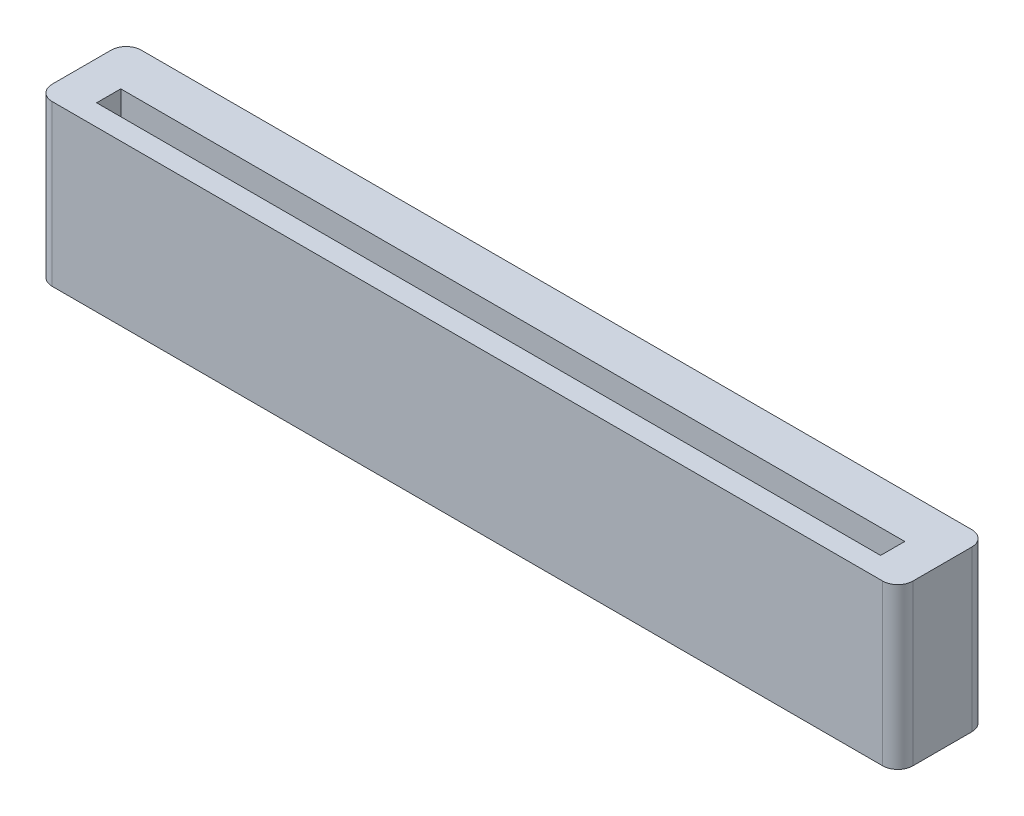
from build123d import *

# Parameters (mm, degrees)
EXTRUSION1_DEPTH        = 10.6
ESQUISSE2_W             = 51.92
ESQUISSE2_H             = 1.6
ENL_V_MAT_EXTRU_1_DEPTH = 6


with BuildPart() as part:
    # Esquisse1 → Extrusion1 (new body)
    with BuildSketch(Plane(origin=(0, 0, 0), x_dir=(1, 0, 0), z_dir=(0, 1, 0))):
        with BuildLine():
            Line((1, 0), (56, 0))
            ThreePointArc((56, 0), (56.707106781, 0.292893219), (57, 1))
            Line((57, 1), (57, 4.9))
            ThreePointArc((57, 4.9), (56.707106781, 5.607106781), (56, 5.9))
            Line((56, 5.9), (1, 5.9))
            ThreePointArc((1, 5.9), (0.292893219, 5.607106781), (0, 4.9))
            Line((0, 4.9), (0, 1))
            ThreePointArc((0, 1), (0.292893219, 0.292893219), (1, 0))
        make_face()
    extrude(amount=EXTRUSION1_DEPTH)

    # Esquisse2 → Enl_v. mat.-Extru.1 (cut)
    with BuildSketch(Plane(origin=(0, 10.6, 0), x_dir=(-1, 0, 0), z_dir=(0, 1, 0))):
        with Locations((-28.5, -2.2)):
            Rectangle(ESQUISSE2_W, ESQUISSE2_H)
    extrude(amount=-ENL_V_MAT_EXTRU_1_DEPTH, mode=Mode.SUBTRACT)


solid = part.part
